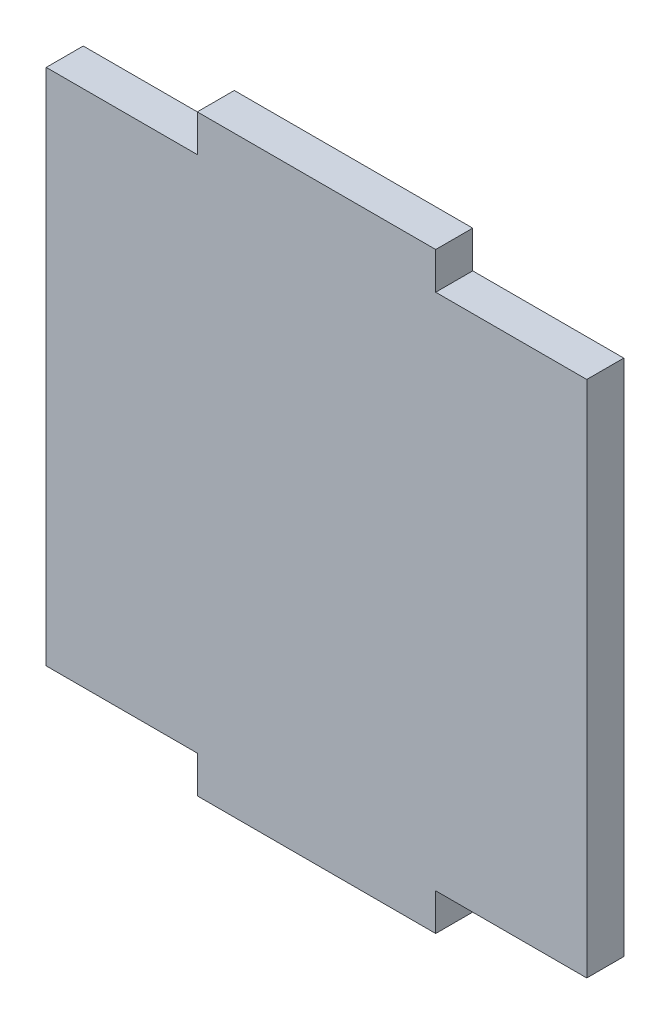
from build123d import *

# Parameters (mm, degrees)
BOSS_EXTRUDE1_DEPTH = 2.5


with BuildPart() as part:
    # Sketch1 → Boss-Extrude1 (new body)
    with BuildSketch(Plane.XY):
        Polygon((-8.049101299, 0), (8.049101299, 0), (8.049101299, -2.5), (18.249101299, -2.5), (18.249101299, -37.5), (8.049101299, -37.5), (8.049101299, -40), (-8.049101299, -40), (-8.049101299, -37.5), (-18.249101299, -37.5), (-18.249101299, -2.5), (-8.049101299, -2.5), align=None)
    extrude(amount=BOSS_EXTRUDE1_DEPTH)


solid = part.part
